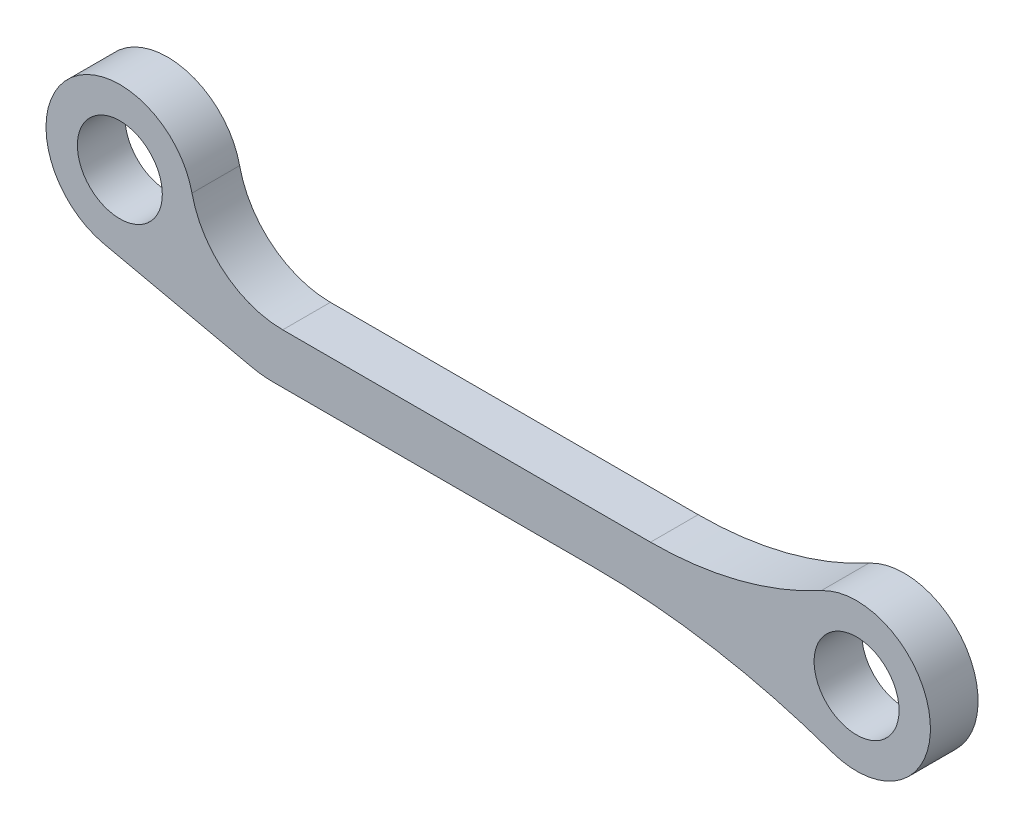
ISO-10303-21;
HEADER;
FILE_DESCRIPTION(('STEP AP214'),'2;1');
FILE_NAME('part.step','',(''),(''),'','','');
FILE_SCHEMA(('AUTOMOTIVE_DESIGN { 1 0 10303 214 1 1 1 1 }'));
ENDSEC;
DATA;
#1=APPLICATION_CONTEXT('core data for automotive mechanical design processes');
#2=APPLICATION_PROTOCOL_DEFINITION('international standard','automotive_design',2000,#1);
#3=PRODUCT_CONTEXT('',#1,'mechanical');
#4=PRODUCT('Part','Part','',(#3));
#5=PRODUCT_RELATED_PRODUCT_CATEGORY('part','',(#4));
#6=PRODUCT_DEFINITION_FORMATION('','',#4);
#7=PRODUCT_DEFINITION_CONTEXT('part definition',#1,'design');
#8=PRODUCT_DEFINITION('design','',#6,#7);
#9=PRODUCT_DEFINITION_SHAPE('','',#8);
#10=(LENGTH_UNIT() NAMED_UNIT(*) SI_UNIT(.MILLI.,.METRE.));
#11=(NAMED_UNIT(*) PLANE_ANGLE_UNIT() SI_UNIT($,.RADIAN.));
#12=(NAMED_UNIT(*) SI_UNIT($,.STERADIAN.) SOLID_ANGLE_UNIT());
#13=UNCERTAINTY_MEASURE_WITH_UNIT(LENGTH_MEASURE(1.E-05),#10,'distance_accuracy_value','');
#14=(GEOMETRIC_REPRESENTATION_CONTEXT(3) GLOBAL_UNCERTAINTY_ASSIGNED_CONTEXT((#13)) GLOBAL_UNIT_ASSIGNED_CONTEXT((#10,
#11,#12)) REPRESENTATION_CONTEXT('',''));
#15=CARTESIAN_POINT('',(0.,0.,0.));
#16=DIRECTION('',(0.,0.,1.));
#17=DIRECTION('',(1.,0.,0.));
#18=AXIS2_PLACEMENT_3D('',#15,#16,#17);
#19=CARTESIAN_POINT('',(6.4135579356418,-0.500000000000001,0.));
#20=DIRECTION('',(0.,0.,1.));
#21=DIRECTION('',(1.,0.,0.));
#22=AXIS2_PLACEMENT_3D('',#19,#20,#21);
#23=CYLINDRICAL_SURFACE('',#22,4.);
#24=CARTESIAN_POINT('',(6.4135579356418,-0.500000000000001,0.));
#25=DIRECTION('',(0.,0.,1.));
#26=DIRECTION('',(1.,0.,0.));
#27=AXIS2_PLACEMENT_3D('',#24,#25,#26);
#28=CIRCLE('',#27,4.);
#29=CARTESIAN_POINT('',(5.54779947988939,-4.40518402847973,0.));
#30=VERTEX_POINT('',#29);
#31=CARTESIAN_POINT('',(6.4135579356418,-4.50000000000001,0.));
#32=VERTEX_POINT('',#31);
#33=EDGE_CURVE('E95',#30,#32,#28,.T.);
#34=ORIENTED_EDGE('',*,*,#33,.T.);
#35=DIRECTION('',(0.,0.,-1.));
#36=VECTOR('',#35,1.);
#37=CARTESIAN_POINT('',(6.4135579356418,-4.50000000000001,0.));
#38=LINE('',#37,#36);
#39=CARTESIAN_POINT('',(6.4135579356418,-4.5,2.));
#40=VERTEX_POINT('',#39);
#41=EDGE_CURVE('E93',#40,#32,#38,.T.);
#42=ORIENTED_EDGE('',*,*,#41,.F.);
#43=CARTESIAN_POINT('',(6.4135579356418,-0.500000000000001,2.));
#44=DIRECTION('',(0.,0.,1.));
#45=DIRECTION('',(1.,0.,0.));
#46=AXIS2_PLACEMENT_3D('',#43,#44,#45);
#47=CIRCLE('',#46,4.);
#48=CARTESIAN_POINT('',(5.54779947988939,-4.40518402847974,2.));
#49=VERTEX_POINT('',#48);
#50=EDGE_CURVE('E20',#40,#49,#47,.F.);
#51=ORIENTED_EDGE('',*,*,#50,.T.);
#52=DIRECTION('',(0.,0.,1.));
#53=VECTOR('',#52,1.);
#54=CARTESIAN_POINT('',(5.54779947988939,-4.40518402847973,0.));
#55=LINE('',#54,#53);
#56=EDGE_CURVE('E90',#30,#49,#55,.T.);
#57=ORIENTED_EDGE('',*,*,#56,.F.);
#58=EDGE_LOOP('',(#34,#42,#51,#57));
#59=FACE_BOUND('',#58,.T.);
#60=ADVANCED_FACE('F17',(#59),#23,.T.);
#61=CARTESIAN_POINT('',(15.134812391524,-2.69029306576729,0.));
#62=DIRECTION('',(0.,0.,1.));
#63=DIRECTION('',(1.,0.,0.));
#64=AXIS2_PLACEMENT_3D('',#61,#62,#63);
#65=PLANE('',#64);
#66=CARTESIAN_POINT('',(0.,0.,0.));
#67=DIRECTION('',(0.,0.,1.));
#68=DIRECTION('',(1.,0.,0.));
#69=AXIS2_PLACEMENT_3D('',#66,#67,#68);
#70=CIRCLE('',#69,1.783);
#71=CARTESIAN_POINT('',(1.783,0.,0.));
#72=VERTEX_POINT('',#71);
#73=EDGE_CURVE('E160',#72,#72,#70,.T.);
#74=ORIENTED_EDGE('',*,*,#73,.T.);
#75=EDGE_LOOP('',(#74));
#76=FACE_BOUND('',#75,.T.);
#77=CARTESIAN_POINT('',(30.9244240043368,-3.3,0.));
#78=DIRECTION('',(0.,0.,1.));
#79=DIRECTION('',(1.,0.,0.));
#80=AXIS2_PLACEMENT_3D('',#77,#78,#79);
#81=CIRCLE('',#80,1.783);
#82=CARTESIAN_POINT('',(32.7074240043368,-3.3,0.));
#83=VERTEX_POINT('',#82);
#84=EDGE_CURVE('E124',#83,#83,#81,.T.);
#85=ORIENTED_EDGE('',*,*,#84,.T.);
#86=EDGE_LOOP('',(#85));
#87=FACE_BOUND('',#86,.T.);
#88=CARTESIAN_POINT('',(22.2757246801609,12.6,0.));
#89=DIRECTION('',(0.,0.,1.));
#90=DIRECTION('',(1.,0.,0.));
#91=AXIS2_PLACEMENT_3D('',#88,#89,#90);
#92=CIRCLE('',#91,15.);
#93=CARTESIAN_POINT('',(22.2757246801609,-2.4,0.));
#94=VERTEX_POINT('',#93);
#95=CARTESIAN_POINT('',(29.4431550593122,-0.576795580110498,0.));
#96=VERTEX_POINT('',#95);
#97=EDGE_CURVE('E145',#94,#96,#92,.T.);
#98=ORIENTED_EDGE('',*,*,#97,.T.);
#99=CARTESIAN_POINT('',(30.9244240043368,-3.3,0.));
#100=DIRECTION('',(0.,0.,1.));
#101=DIRECTION('',(1.,0.,0.));
#102=AXIS2_PLACEMENT_3D('',#99,#100,#101);
#103=CIRCLE('',#102,3.1);
#104=CARTESIAN_POINT('',(29.8892437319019,-6.22205438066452,0.));
#105=VERTEX_POINT('',#104);
#106=EDGE_CURVE('E125',#105,#96,#103,.T.);
#107=ORIENTED_EDGE('',*,*,#106,.F.);
#108=CARTESIAN_POINT('',(19.8713701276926,-34.4999999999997,0.));
#109=DIRECTION('',(0.,0.,1.));
#110=DIRECTION('',(1.,0.,0.));
#111=AXIS2_PLACEMENT_3D('',#108,#109,#110);
#112=CIRCLE('',#111,30.);
#113=CARTESIAN_POINT('',(19.8713701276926,-4.49999999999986,0.));
#114=VERTEX_POINT('',#113);
#115=EDGE_CURVE('E129',#105,#114,#112,.T.);
#116=ORIENTED_EDGE('',*,*,#115,.T.);
#117=DIRECTION('',(1.,0.,0.));
#118=VECTOR('',#117,1.);
#119=CARTESIAN_POINT('',(19.8713701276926,-4.50000000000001,0.));
#120=LINE('',#119,#118);
#121=EDGE_CURVE('E131',#32,#114,#120,.T.);
#122=ORIENTED_EDGE('',*,*,#121,.F.);
#123=ORIENTED_EDGE('',*,*,#33,.F.);
#124=DIRECTION('',(0.976296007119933,-0.216439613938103,0.));
#125=VECTOR('',#124,1.);
#126=CARTESIAN_POINT('',(5.54779947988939,-4.40518402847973,0.));
#127=LINE('',#126,#125);
#128=CARTESIAN_POINT('',(-0.670962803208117,-3.02651762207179,0.));
#129=VERTEX_POINT('',#128);
#130=EDGE_CURVE('E103',#129,#30,#127,.T.);
#131=ORIENTED_EDGE('',*,*,#130,.F.);
#132=CARTESIAN_POINT('',(0.,0.,0.));
#133=DIRECTION('',(0.,0.,1.));
#134=DIRECTION('',(1.,0.,0.));
#135=AXIS2_PLACEMENT_3D('',#132,#133,#134);
#136=CIRCLE('',#135,3.1);
#137=CARTESIAN_POINT('',(3.02799017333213,0.664285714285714,0.));
#138=VERTEX_POINT('',#137);
#139=EDGE_CURVE('E133',#138,#129,#136,.T.);
#140=ORIENTED_EDGE('',*,*,#139,.F.);
#141=CARTESIAN_POINT('',(6.83739716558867,1.5,0.));
#142=DIRECTION('',(0.,0.,1.));
#143=DIRECTION('',(1.,0.,0.));
#144=AXIS2_PLACEMENT_3D('',#141,#142,#143);
#145=CIRCLE('',#144,3.9);
#146=CARTESIAN_POINT('',(6.83739716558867,-2.4,0.));
#147=VERTEX_POINT('',#146);
#148=EDGE_CURVE('E140',#138,#147,#145,.T.);
#149=ORIENTED_EDGE('',*,*,#148,.T.);
#150=DIRECTION('',(1.,0.,0.));
#151=VECTOR('',#150,1.);
#152=CARTESIAN_POINT('',(6.83739716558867,-2.4,0.));
#153=LINE('',#152,#151);
#154=EDGE_CURVE('E144',#94,#147,#153,.F.);
#155=ORIENTED_EDGE('',*,*,#154,.F.);
#156=EDGE_LOOP('',(#98,#107,#116,#122,#123,#131,#140,#149,#155));
#157=FACE_BOUND('',#156,.T.);
#158=ADVANCED_FACE('F172',(#76,#87,#157),#65,.F.);
#159=CARTESIAN_POINT('',(22.2757246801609,12.6,0.));
#160=DIRECTION('',(0.,0.,1.));
#161=DIRECTION('',(1.,0.,0.));
#162=AXIS2_PLACEMENT_3D('',#159,#160,#161);
#163=CYLINDRICAL_SURFACE('',#162,15.);
#164=DIRECTION('',(0.,0.,1.));
#165=VECTOR('',#164,1.);
#166=CARTESIAN_POINT('',(29.4431550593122,-0.576795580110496,0.));
#167=LINE('',#166,#165);
#168=CARTESIAN_POINT('',(29.4431550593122,-0.576795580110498,2.));
#169=VERTEX_POINT('',#168);
#170=EDGE_CURVE('E121',#96,#169,#167,.T.);
#171=ORIENTED_EDGE('',*,*,#170,.F.);
#172=ORIENTED_EDGE('',*,*,#97,.F.);
#173=DIRECTION('',(0.,0.,1.));
#174=VECTOR('',#173,1.);
#175=CARTESIAN_POINT('',(22.2757246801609,-2.4,0.));
#176=LINE('',#175,#174);
#177=CARTESIAN_POINT('',(22.2757246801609,-2.4,2.));
#178=VERTEX_POINT('',#177);
#179=EDGE_CURVE('E141',#178,#94,#176,.F.);
#180=ORIENTED_EDGE('',*,*,#179,.F.);
#181=CARTESIAN_POINT('',(22.2757246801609,12.6,2.));
#182=DIRECTION('',(0.,0.,1.));
#183=DIRECTION('',(1.,0.,0.));
#184=AXIS2_PLACEMENT_3D('',#181,#182,#183);
#185=CIRCLE('',#184,15.);
#186=EDGE_CURVE('E120',#169,#178,#185,.F.);
#187=ORIENTED_EDGE('',*,*,#186,.F.);
#188=EDGE_LOOP('',(#171,#172,#180,#187));
#189=FACE_BOUND('',#188,.T.);
#190=ADVANCED_FACE('F183',(#189),#163,.F.);
#191=CARTESIAN_POINT('',(6.83739716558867,-2.4,0.));
#192=DIRECTION('',(0.,1.,0.));
#193=DIRECTION('',(0.,0.,1.));
#194=AXIS2_PLACEMENT_3D('',#191,#192,#193);
#195=PLANE('',#194);
#196=ORIENTED_EDGE('',*,*,#154,.T.);
#197=DIRECTION('',(0.,0.,1.));
#198=VECTOR('',#197,1.);
#199=CARTESIAN_POINT('',(6.83739716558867,-2.4,0.));
#200=LINE('',#199,#198);
#201=CARTESIAN_POINT('',(6.83739716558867,-2.4,2.));
#202=VERTEX_POINT('',#201);
#203=EDGE_CURVE('E138',#147,#202,#200,.T.);
#204=ORIENTED_EDGE('',*,*,#203,.T.);
#205=DIRECTION('',(1.,0.,0.));
#206=VECTOR('',#205,1.);
#207=CARTESIAN_POINT('',(15.134812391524,-2.4,2.));
#208=LINE('',#207,#206);
#209=EDGE_CURVE('E117',#178,#202,#208,.F.);
#210=ORIENTED_EDGE('',*,*,#209,.F.);
#211=ORIENTED_EDGE('',*,*,#179,.T.);
#212=EDGE_LOOP('',(#196,#204,#210,#211));
#213=FACE_BOUND('',#212,.T.);
#214=ADVANCED_FACE('F187',(#213),#195,.T.);
#215=CARTESIAN_POINT('',(6.83739716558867,1.5,0.));
#216=DIRECTION('',(0.,0.,1.));
#217=DIRECTION('',(1.,0.,0.));
#218=AXIS2_PLACEMENT_3D('',#215,#216,#217);
#219=CYLINDRICAL_SURFACE('',#218,3.9);
#220=ORIENTED_EDGE('',*,*,#203,.F.);
#221=ORIENTED_EDGE('',*,*,#148,.F.);
#222=DIRECTION('',(0.,0.,1.));
#223=VECTOR('',#222,1.);
#224=CARTESIAN_POINT('',(3.02799017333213,0.664285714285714,0.));
#225=LINE('',#224,#223);
#226=CARTESIAN_POINT('',(3.02799017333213,0.664285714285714,2.));
#227=VERTEX_POINT('',#226);
#228=EDGE_CURVE('E135',#227,#138,#225,.F.);
#229=ORIENTED_EDGE('',*,*,#228,.F.);
#230=CARTESIAN_POINT('',(6.83739716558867,1.5,2.));
#231=DIRECTION('',(0.,0.,1.));
#232=DIRECTION('',(1.,0.,0.));
#233=AXIS2_PLACEMENT_3D('',#230,#231,#232);
#234=CIRCLE('',#233,3.9);
#235=EDGE_CURVE('E114',#202,#227,#234,.F.);
#236=ORIENTED_EDGE('',*,*,#235,.F.);
#237=EDGE_LOOP('',(#220,#221,#229,#236));
#238=FACE_BOUND('',#237,.T.);
#239=ADVANCED_FACE('F190',(#238),#219,.F.);
#240=CARTESIAN_POINT('',(0.,0.,0.));
#241=DIRECTION('',(0.,0.,1.));
#242=DIRECTION('',(1.,0.,0.));
#243=AXIS2_PLACEMENT_3D('',#240,#241,#242);
#244=CYLINDRICAL_SURFACE('',#243,3.1);
#245=ORIENTED_EDGE('',*,*,#139,.T.);
#246=DIRECTION('',(0.,0.,1.));
#247=VECTOR('',#246,1.);
#248=CARTESIAN_POINT('',(-0.670962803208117,-3.02651762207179,0.));
#249=LINE('',#248,#247);
#250=CARTESIAN_POINT('',(-0.670962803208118,-3.02651762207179,2.));
#251=VERTEX_POINT('',#250);
#252=EDGE_CURVE('E132',#251,#129,#249,.F.);
#253=ORIENTED_EDGE('',*,*,#252,.F.);
#254=CARTESIAN_POINT('',(0.,0.,2.));
#255=DIRECTION('',(0.,0.,1.));
#256=DIRECTION('',(1.,0.,0.));
#257=AXIS2_PLACEMENT_3D('',#254,#255,#256);
#258=CIRCLE('',#257,3.1);
#259=EDGE_CURVE('E109',#227,#251,#258,.T.);
#260=ORIENTED_EDGE('',*,*,#259,.F.);
#261=ORIENTED_EDGE('',*,*,#228,.T.);
#262=EDGE_LOOP('',(#245,#253,#260,#261));
#263=FACE_BOUND('',#262,.T.);
#264=ADVANCED_FACE('F193',(#263),#244,.T.);
#265=CARTESIAN_POINT('',(5.54779947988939,-4.40518402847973,0.));
#266=DIRECTION('',(-0.216439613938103,-0.976296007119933,0.));
#267=DIRECTION('',(0.976296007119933,-0.216439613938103,0.));
#268=AXIS2_PLACEMENT_3D('',#265,#266,#267);
#269=PLANE('',#268);
#270=ORIENTED_EDGE('',*,*,#130,.T.);
#271=ORIENTED_EDGE('',*,*,#56,.T.);
#272=DIRECTION('',(0.976296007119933,-0.216439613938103,0.));
#273=VECTOR('',#272,1.);
#274=CARTESIAN_POINT('',(-0.670962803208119,-3.02651762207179,2.));
#275=LINE('',#274,#273);
#276=EDGE_CURVE('E100',#251,#49,#275,.T.);
#277=ORIENTED_EDGE('',*,*,#276,.F.);
#278=ORIENTED_EDGE('',*,*,#252,.T.);
#279=EDGE_LOOP('',(#270,#271,#277,#278));
#280=FACE_BOUND('',#279,.T.);
#281=ADVANCED_FACE('F98',(#280),#269,.T.);
#282=CARTESIAN_POINT('',(19.8713701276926,-4.50000000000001,0.));
#283=DIRECTION('',(0.,-1.,0.));
#284=DIRECTION('',(0.,0.,-1.));
#285=AXIS2_PLACEMENT_3D('',#282,#283,#284);
#286=PLANE('',#285);
#287=ORIENTED_EDGE('',*,*,#121,.T.);
#288=DIRECTION('',(0.,0.,1.));
#289=VECTOR('',#288,1.);
#290=CARTESIAN_POINT('',(19.8713701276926,-4.49999999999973,0.));
#291=LINE('',#290,#289);
#292=CARTESIAN_POINT('',(19.8713701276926,-4.49999999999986,2.));
#293=VERTEX_POINT('',#292);
#294=EDGE_CURVE('E127',#114,#293,#291,.T.);
#295=ORIENTED_EDGE('',*,*,#294,.T.);
#296=DIRECTION('',(1.,0.,0.));
#297=VECTOR('',#296,1.);
#298=CARTESIAN_POINT('',(15.134812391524,-4.5,2.));
#299=LINE('',#298,#297);
#300=EDGE_CURVE('E110',#40,#293,#299,.T.);
#301=ORIENTED_EDGE('',*,*,#300,.F.);
#302=ORIENTED_EDGE('',*,*,#41,.T.);
#303=EDGE_LOOP('',(#287,#295,#301,#302));
#304=FACE_BOUND('',#303,.T.);
#305=ADVANCED_FACE('F176',(#304),#286,.T.);
#306=CARTESIAN_POINT('',(19.8713701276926,-34.4999999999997,0.));
#307=DIRECTION('',(0.,0.,1.));
#308=DIRECTION('',(1.,0.,0.));
#309=AXIS2_PLACEMENT_3D('',#306,#307,#308);
#310=CYLINDRICAL_SURFACE('',#309,30.);
#311=ORIENTED_EDGE('',*,*,#294,.F.);
#312=ORIENTED_EDGE('',*,*,#115,.F.);
#313=DIRECTION('',(0.,0.,1.));
#314=VECTOR('',#313,1.);
#315=CARTESIAN_POINT('',(29.8892437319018,-6.22205438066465,0.));
#316=LINE('',#315,#314);
#317=CARTESIAN_POINT('',(29.8892437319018,-6.22205438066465,2.));
#318=VERTEX_POINT('',#317);
#319=EDGE_CURVE('E35',#318,#105,#316,.F.);
#320=ORIENTED_EDGE('',*,*,#319,.F.);
#321=CARTESIAN_POINT('',(19.8713701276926,-34.4999999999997,2.));
#322=DIRECTION('',(0.,0.,1.));
#323=DIRECTION('',(1.,0.,0.));
#324=AXIS2_PLACEMENT_3D('',#321,#322,#323);
#325=CIRCLE('',#324,30.);
#326=EDGE_CURVE('E112',#293,#318,#325,.F.);
#327=ORIENTED_EDGE('',*,*,#326,.F.);
#328=EDGE_LOOP('',(#311,#312,#320,#327));
#329=FACE_BOUND('',#328,.T.);
#330=ADVANCED_FACE('F177',(#329),#310,.F.);
#331=CARTESIAN_POINT('',(30.9244240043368,-3.3,0.));
#332=DIRECTION('',(0.,0.,1.));
#333=DIRECTION('',(1.,0.,0.));
#334=AXIS2_PLACEMENT_3D('',#331,#332,#333);
#335=CYLINDRICAL_SURFACE('',#334,3.1);
#336=ORIENTED_EDGE('',*,*,#106,.T.);
#337=ORIENTED_EDGE('',*,*,#170,.T.);
#338=CARTESIAN_POINT('',(30.9244240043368,-3.3,2.));
#339=DIRECTION('',(0.,0.,1.));
#340=DIRECTION('',(1.,0.,0.));
#341=AXIS2_PLACEMENT_3D('',#338,#339,#340);
#342=CIRCLE('',#341,3.1);
#343=EDGE_CURVE('E153',#318,#169,#342,.T.);
#344=ORIENTED_EDGE('',*,*,#343,.F.);
#345=ORIENTED_EDGE('',*,*,#319,.T.);
#346=EDGE_LOOP('',(#336,#337,#344,#345));
#347=FACE_BOUND('',#346,.T.);
#348=ADVANCED_FACE('F181',(#347),#335,.T.);
#349=CARTESIAN_POINT('',(30.9244240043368,-3.3,0.));
#350=DIRECTION('',(0.,0.,1.));
#351=DIRECTION('',(1.,0.,0.));
#352=AXIS2_PLACEMENT_3D('',#349,#350,#351);
#353=CYLINDRICAL_SURFACE('',#352,1.783);
#354=ORIENTED_EDGE('',*,*,#84,.F.);
#355=EDGE_LOOP('',(#354));
#356=FACE_BOUND('',#355,.T.);
#357=CARTESIAN_POINT('',(30.9244240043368,-3.3,2.));
#358=DIRECTION('',(0.,0.,1.));
#359=DIRECTION('',(1.,0.,0.));
#360=AXIS2_PLACEMENT_3D('',#357,#358,#359);
#361=CIRCLE('',#360,1.783);
#362=CARTESIAN_POINT('',(32.7074240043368,-3.3,2.));
#363=VERTEX_POINT('',#362);
#364=EDGE_CURVE('E26',#363,#363,#361,.F.);
#365=ORIENTED_EDGE('',*,*,#364,.F.);
#366=EDGE_LOOP('',(#365));
#367=FACE_BOUND('',#366,.T.);
#368=ADVANCED_FACE('F210',(#356,#367),#353,.F.);
#369=CARTESIAN_POINT('',(0.,0.,0.));
#370=DIRECTION('',(0.,0.,1.));
#371=DIRECTION('',(1.,0.,0.));
#372=AXIS2_PLACEMENT_3D('',#369,#370,#371);
#373=CYLINDRICAL_SURFACE('',#372,1.783);
#374=ORIENTED_EDGE('',*,*,#73,.F.);
#375=EDGE_LOOP('',(#374));
#376=FACE_BOUND('',#375,.T.);
#377=CARTESIAN_POINT('',(0.,0.,2.));
#378=DIRECTION('',(0.,0.,1.));
#379=DIRECTION('',(1.,0.,0.));
#380=AXIS2_PLACEMENT_3D('',#377,#378,#379);
#381=CIRCLE('',#380,1.783);
#382=CARTESIAN_POINT('',(1.783,0.,2.));
#383=VERTEX_POINT('',#382);
#384=EDGE_CURVE('E11',#383,#383,#381,.F.);
#385=ORIENTED_EDGE('',*,*,#384,.F.);
#386=EDGE_LOOP('',(#385));
#387=FACE_BOUND('',#386,.T.);
#388=ADVANCED_FACE('F204',(#376,#387),#373,.F.);
#389=CARTESIAN_POINT('',(15.134812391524,-2.69029306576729,2.));
#390=DIRECTION('',(0.,0.,1.));
#391=DIRECTION('',(1.,0.,0.));
#392=AXIS2_PLACEMENT_3D('',#389,#390,#391);
#393=PLANE('',#392);
#394=ORIENTED_EDGE('',*,*,#384,.T.);
#395=EDGE_LOOP('',(#394));
#396=FACE_BOUND('',#395,.T.);
#397=ORIENTED_EDGE('',*,*,#364,.T.);
#398=EDGE_LOOP('',(#397));
#399=FACE_BOUND('',#398,.T.);
#400=ORIENTED_EDGE('',*,*,#326,.T.);
#401=ORIENTED_EDGE('',*,*,#343,.T.);
#402=ORIENTED_EDGE('',*,*,#186,.T.);
#403=ORIENTED_EDGE('',*,*,#209,.T.);
#404=ORIENTED_EDGE('',*,*,#235,.T.);
#405=ORIENTED_EDGE('',*,*,#259,.T.);
#406=ORIENTED_EDGE('',*,*,#276,.T.);
#407=ORIENTED_EDGE('',*,*,#50,.F.);
#408=ORIENTED_EDGE('',*,*,#300,.T.);
#409=EDGE_LOOP('',(#400,#401,#402,#403,#404,#405,#406,#407,#408));
#410=FACE_BOUND('',#409,.T.);
#411=ADVANCED_FACE('F106',(#396,#399,#410),#393,.T.);
#412=CLOSED_SHELL('',(#60,#158,#190,#214,#239,#264,#281,#305,#330,#348,#368,#388,#411));
#413=MANIFOLD_SOLID_BREP('B1',#412);
#414=ADVANCED_BREP_SHAPE_REPRESENTATION('',(#18,#413),#14);
#415=SHAPE_DEFINITION_REPRESENTATION(#9,#414);
ENDSEC;
END-ISO-10303-21;
